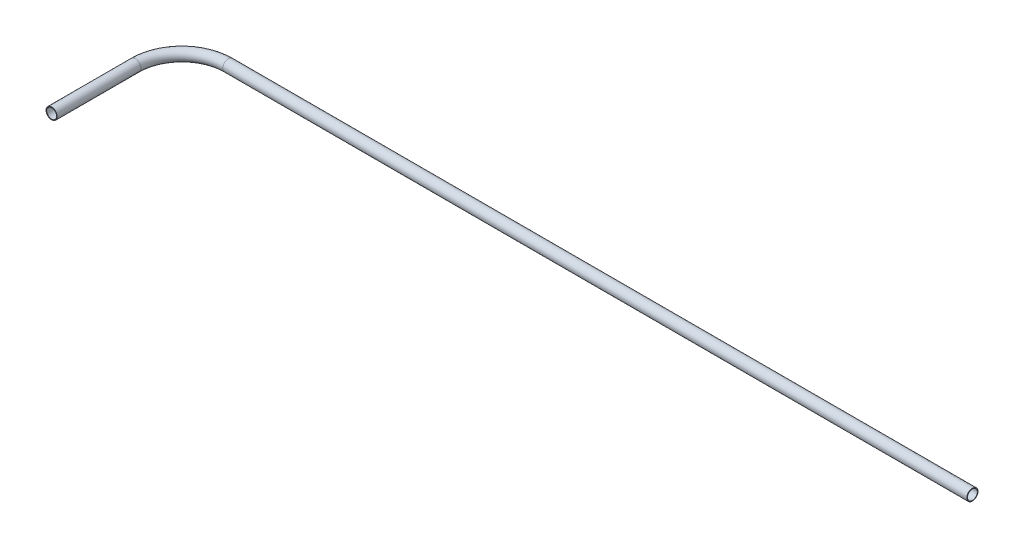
ISO-10303-21;
HEADER;
FILE_DESCRIPTION(('STEP AP214'),'2;1');
FILE_NAME('part.step','',(''),(''),'','','');
FILE_SCHEMA(('AUTOMOTIVE_DESIGN { 1 0 10303 214 1 1 1 1 }'));
ENDSEC;
DATA;
#1=APPLICATION_CONTEXT('core data for automotive mechanical design processes');
#2=APPLICATION_PROTOCOL_DEFINITION('international standard','automotive_design',2000,#1);
#3=PRODUCT_CONTEXT('',#1,'mechanical');
#4=PRODUCT('Part','Part','',(#3));
#5=PRODUCT_RELATED_PRODUCT_CATEGORY('part','',(#4));
#6=PRODUCT_DEFINITION_FORMATION('','',#4);
#7=PRODUCT_DEFINITION_CONTEXT('part definition',#1,'design');
#8=PRODUCT_DEFINITION('design','',#6,#7);
#9=PRODUCT_DEFINITION_SHAPE('','',#8);
#10=(LENGTH_UNIT() NAMED_UNIT(*) SI_UNIT(.MILLI.,.METRE.));
#11=(NAMED_UNIT(*) PLANE_ANGLE_UNIT() SI_UNIT($,.RADIAN.));
#12=(NAMED_UNIT(*) SI_UNIT($,.STERADIAN.) SOLID_ANGLE_UNIT());
#13=UNCERTAINTY_MEASURE_WITH_UNIT(LENGTH_MEASURE(1.E-05),#10,'distance_accuracy_value','');
#14=(GEOMETRIC_REPRESENTATION_CONTEXT(3) GLOBAL_UNCERTAINTY_ASSIGNED_CONTEXT((#13)) GLOBAL_UNIT_ASSIGNED_CONTEXT((#10,
#11,#12)) REPRESENTATION_CONTEXT('',''));
#15=CARTESIAN_POINT('',(0.,0.,0.));
#16=DIRECTION('',(0.,0.,1.));
#17=DIRECTION('',(1.,0.,0.));
#18=AXIS2_PLACEMENT_3D('',#15,#16,#17);
#19=CARTESIAN_POINT('',(0.,0.,-450.));
#20=DIRECTION('',(0.,0.,1.));
#21=DIRECTION('',(1.,0.,0.));
#22=AXIS2_PLACEMENT_3D('',#19,#20,#21);
#23=CYLINDRICAL_SURFACE('',#22,26.5);
#24=CARTESIAN_POINT('',(0.,0.,-450.));
#25=DIRECTION('',(0.,0.,-1.));
#26=DIRECTION('',(-1.,0.,0.));
#27=AXIS2_PLACEMENT_3D('',#24,#25,#26);
#28=CIRCLE('',#27,26.5);
#29=CARTESIAN_POINT('',(-26.5,0.,-450.));
#30=VERTEX_POINT('',#29);
#31=EDGE_CURVE('E50',#30,#30,#28,.T.);
#32=ORIENTED_EDGE('',*,*,#31,.T.);
#33=EDGE_LOOP('',(#32));
#34=FACE_BOUND('',#33,.T.);
#35=CARTESIAN_POINT('',(0.,0.,0.));
#36=DIRECTION('',(0.,0.,-1.));
#37=DIRECTION('',(-1.,0.,0.));
#38=AXIS2_PLACEMENT_3D('',#35,#36,#37);
#39=CIRCLE('',#38,26.5);
#40=CARTESIAN_POINT('',(-26.5,0.,0.));
#41=VERTEX_POINT('',#40);
#42=EDGE_CURVE('E41',#41,#41,#39,.T.);
#43=ORIENTED_EDGE('',*,*,#42,.F.);
#44=EDGE_LOOP('',(#43));
#45=FACE_BOUND('',#44,.T.);
#46=ADVANCED_FACE('F31',(#34,#45),#23,.F.);
#47=CARTESIAN_POINT('',(0.,0.,-450.));
#48=DIRECTION('',(0.,0.,1.));
#49=DIRECTION('',(1.,0.,0.));
#50=AXIS2_PLACEMENT_3D('',#47,#48,#49);
#51=CYLINDRICAL_SURFACE('',#50,30.15);
#52=CARTESIAN_POINT('',(0.,0.,-450.));
#53=DIRECTION('',(0.,0.,-1.));
#54=DIRECTION('',(-1.,0.,0.));
#55=AXIS2_PLACEMENT_3D('',#52,#53,#54);
#56=CIRCLE('',#55,30.15);
#57=CARTESIAN_POINT('',(-30.15,0.,-450.));
#58=VERTEX_POINT('',#57);
#59=EDGE_CURVE('E10',#58,#58,#56,.T.);
#60=ORIENTED_EDGE('',*,*,#59,.F.);
#61=EDGE_LOOP('',(#60));
#62=FACE_BOUND('',#61,.T.);
#63=CARTESIAN_POINT('',(0.,0.,0.));
#64=DIRECTION('',(0.,0.,-1.));
#65=DIRECTION('',(-1.,0.,0.));
#66=AXIS2_PLACEMENT_3D('',#63,#64,#65);
#67=CIRCLE('',#66,30.15);
#68=CARTESIAN_POINT('',(-30.15,0.,0.));
#69=VERTEX_POINT('',#68);
#70=EDGE_CURVE('E37',#69,#69,#67,.T.);
#71=ORIENTED_EDGE('',*,*,#70,.T.);
#72=EDGE_LOOP('',(#71));
#73=FACE_BOUND('',#72,.T.);
#74=ADVANCED_FACE('F83',(#62,#73),#51,.T.);
#75=CARTESIAN_POINT('',(0.,0.,0.));
#76=DIRECTION('',(0.,0.,-1.));
#77=DIRECTION('',(-1.,0.,0.));
#78=AXIS2_PLACEMENT_3D('',#75,#76,#77);
#79=PLANE('',#78);
#80=ORIENTED_EDGE('',*,*,#42,.T.);
#81=EDGE_LOOP('',(#80));
#82=FACE_BOUND('',#81,.T.);
#83=ORIENTED_EDGE('',*,*,#70,.F.);
#84=EDGE_LOOP('',(#83));
#85=FACE_BOUND('',#84,.T.);
#86=ADVANCED_FACE('F88',(#82,#85),#79,.F.);
#87=CARTESIAN_POINT('',(250.,0.,-450.));
#88=DIRECTION('',(0.,1.,0.));
#89=DIRECTION('',(0.,0.,1.));
#90=AXIS2_PLACEMENT_3D('',#87,#88,#89);
#91=TOROIDAL_SURFACE('',#90,250.,26.5);
#92=CARTESIAN_POINT('',(250.,0.,-700.));
#93=DIRECTION('',(1.,0.,0.));
#94=DIRECTION('',(0.,0.,-1.));
#95=AXIS2_PLACEMENT_3D('',#92,#93,#94);
#96=CIRCLE('',#95,26.5);
#97=CARTESIAN_POINT('',(250.,0.,-726.5));
#98=VERTEX_POINT('',#97);
#99=EDGE_CURVE('E59',#98,#98,#96,.T.);
#100=CARTESIAN_POINT('',(250.,0.,-450.));
#101=DIRECTION('',(0.,1.,0.));
#102=DIRECTION('',(0.,0.,1.));
#103=AXIS2_PLACEMENT_3D('',#100,#101,#102);
#104=CIRCLE('',#103,276.5);
#105=EDGE_CURVE('',#98,#30,#104,.T.);
#106=ORIENTED_EDGE('',*,*,#99,.T.);
#107=ORIENTED_EDGE('',*,*,#31,.F.);
#108=ORIENTED_EDGE('',*,*,#105,.T.);
#109=ORIENTED_EDGE('',*,*,#105,.F.);
#110=EDGE_LOOP('',(#106,#108,#107,#109));
#111=FACE_BOUND('',#110,.T.);
#112=ADVANCED_FACE('F63',(#111),#91,.F.);
#113=CARTESIAN_POINT('',(250.,0.,-450.));
#114=DIRECTION('',(0.,1.,0.));
#115=DIRECTION('',(0.,0.,1.));
#116=AXIS2_PLACEMENT_3D('',#113,#114,#115);
#117=TOROIDAL_SURFACE('',#116,250.,30.15);
#118=CARTESIAN_POINT('',(250.,0.,-700.));
#119=DIRECTION('',(1.,0.,0.));
#120=DIRECTION('',(0.,0.,-1.));
#121=AXIS2_PLACEMENT_3D('',#118,#119,#120);
#122=CIRCLE('',#121,30.15);
#123=CARTESIAN_POINT('',(250.,0.,-730.15));
#124=VERTEX_POINT('',#123);
#125=EDGE_CURVE('E45',#124,#124,#122,.T.);
#126=CARTESIAN_POINT('',(250.,0.,-450.));
#127=DIRECTION('',(0.,1.,0.));
#128=DIRECTION('',(0.,0.,1.));
#129=AXIS2_PLACEMENT_3D('',#126,#127,#128);
#130=CIRCLE('',#129,280.15);
#131=EDGE_CURVE('',#124,#58,#130,.T.);
#132=ORIENTED_EDGE('',*,*,#125,.F.);
#133=ORIENTED_EDGE('',*,*,#59,.T.);
#134=ORIENTED_EDGE('',*,*,#131,.T.);
#135=ORIENTED_EDGE('',*,*,#131,.F.);
#136=EDGE_LOOP('',(#132,#134,#133,#135));
#137=FACE_BOUND('',#136,.T.);
#138=ADVANCED_FACE('F69',(#137),#117,.T.);
#139=CARTESIAN_POINT('',(4250.,0.,-700.));
#140=DIRECTION('',(-1.,0.,0.));
#141=DIRECTION('',(0.,0.,1.));
#142=AXIS2_PLACEMENT_3D('',#139,#140,#141);
#143=CYLINDRICAL_SURFACE('',#142,26.5);
#144=CARTESIAN_POINT('',(4250.,0.,-700.));
#145=DIRECTION('',(1.,0.,0.));
#146=DIRECTION('',(0.,0.,-1.));
#147=AXIS2_PLACEMENT_3D('',#144,#145,#146);
#148=CIRCLE('',#147,26.5);
#149=CARTESIAN_POINT('',(4250.,0.,-726.5));
#150=VERTEX_POINT('',#149);
#151=EDGE_CURVE('E56',#150,#150,#148,.T.);
#152=ORIENTED_EDGE('',*,*,#151,.T.);
#153=EDGE_LOOP('',(#152));
#154=FACE_BOUND('',#153,.T.);
#155=ORIENTED_EDGE('',*,*,#99,.F.);
#156=EDGE_LOOP('',(#155));
#157=FACE_BOUND('',#156,.T.);
#158=ADVANCED_FACE('F66',(#154,#157),#143,.F.);
#159=CARTESIAN_POINT('',(4250.,0.,-700.));
#160=DIRECTION('',(-1.,0.,0.));
#161=DIRECTION('',(0.,0.,1.));
#162=AXIS2_PLACEMENT_3D('',#159,#160,#161);
#163=CYLINDRICAL_SURFACE('',#162,30.15);
#164=CARTESIAN_POINT('',(4250.,0.,-700.));
#165=DIRECTION('',(1.,0.,0.));
#166=DIRECTION('',(0.,0.,-1.));
#167=AXIS2_PLACEMENT_3D('',#164,#165,#166);
#168=CIRCLE('',#167,30.15);
#169=CARTESIAN_POINT('',(4250.,0.,-730.15));
#170=VERTEX_POINT('',#169);
#171=EDGE_CURVE('E53',#170,#170,#168,.T.);
#172=ORIENTED_EDGE('',*,*,#171,.F.);
#173=EDGE_LOOP('',(#172));
#174=FACE_BOUND('',#173,.T.);
#175=ORIENTED_EDGE('',*,*,#125,.T.);
#176=EDGE_LOOP('',(#175));
#177=FACE_BOUND('',#176,.T.);
#178=ADVANCED_FACE('F68',(#174,#177),#163,.T.);
#179=CARTESIAN_POINT('',(4250.,0.,-700.));
#180=DIRECTION('',(1.,0.,0.));
#181=DIRECTION('',(0.,0.,-1.));
#182=AXIS2_PLACEMENT_3D('',#179,#180,#181);
#183=PLANE('',#182);
#184=ORIENTED_EDGE('',*,*,#151,.F.);
#185=EDGE_LOOP('',(#184));
#186=FACE_BOUND('',#185,.T.);
#187=ORIENTED_EDGE('',*,*,#171,.T.);
#188=EDGE_LOOP('',(#187));
#189=FACE_BOUND('',#188,.T.);
#190=ADVANCED_FACE('F76',(#186,#189),#183,.T.);
#191=CLOSED_SHELL('',(#46,#74,#86,#112,#138,#158,#178,#190));
#192=MANIFOLD_SOLID_BREP('B2',#191);
#193=ADVANCED_BREP_SHAPE_REPRESENTATION('',(#18,#192),#14);
#194=SHAPE_DEFINITION_REPRESENTATION(#9,#193);
ENDSEC;
END-ISO-10303-21;
